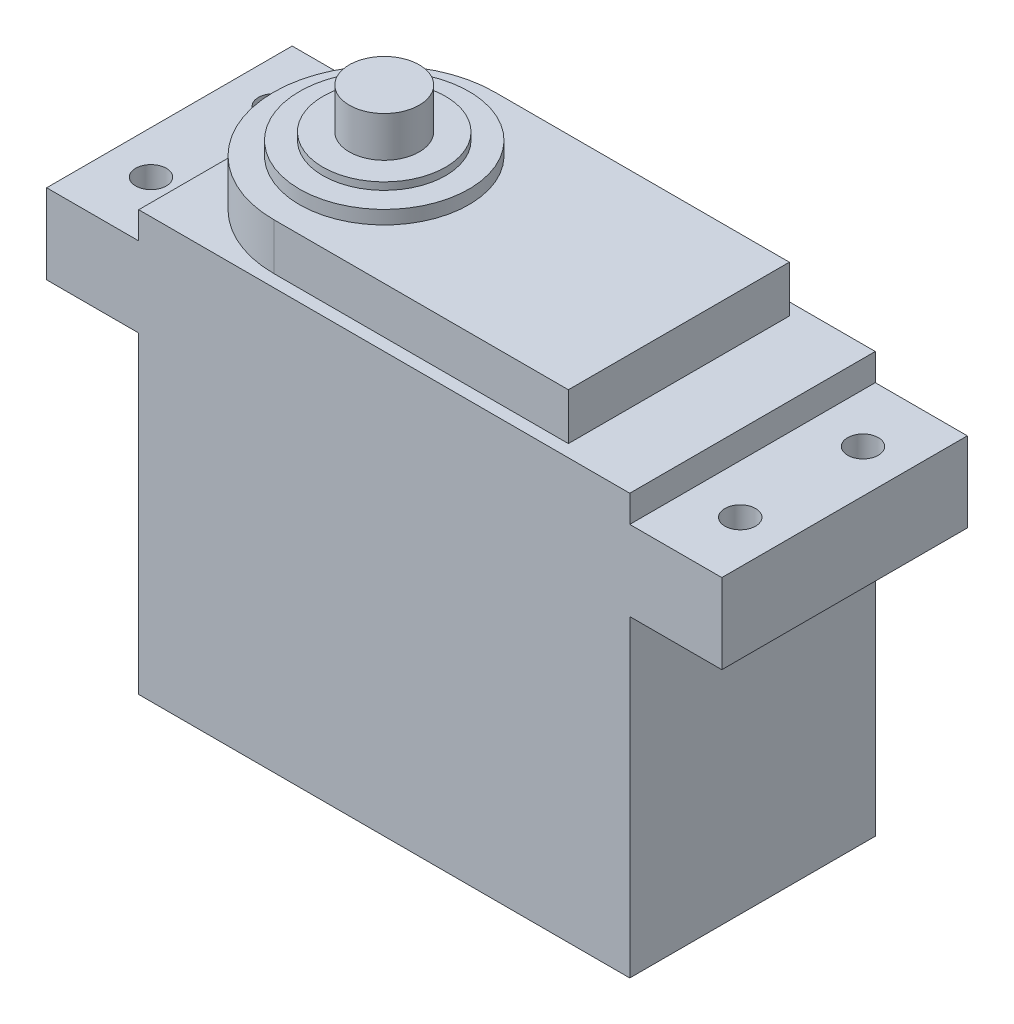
ISO-10303-21;
HEADER;
FILE_DESCRIPTION(('STEP AP214'),'2;1');
FILE_NAME('part.step','',(''),(''),'','','');
FILE_SCHEMA(('AUTOMOTIVE_DESIGN { 1 0 10303 214 1 1 1 1 }'));
ENDSEC;
DATA;
#1=APPLICATION_CONTEXT('core data for automotive mechanical design processes');
#2=APPLICATION_PROTOCOL_DEFINITION('international standard','automotive_design',2000,#1);
#3=PRODUCT_CONTEXT('',#1,'mechanical');
#4=PRODUCT('Part','Part','',(#3));
#5=PRODUCT_RELATED_PRODUCT_CATEGORY('part','',(#4));
#6=PRODUCT_DEFINITION_FORMATION('','',#4);
#7=PRODUCT_DEFINITION_CONTEXT('part definition',#1,'design');
#8=PRODUCT_DEFINITION('design','',#6,#7);
#9=PRODUCT_DEFINITION_SHAPE('','',#8);
#10=(LENGTH_UNIT() NAMED_UNIT(*) SI_UNIT(.MILLI.,.METRE.));
#11=(NAMED_UNIT(*) PLANE_ANGLE_UNIT() SI_UNIT($,.RADIAN.));
#12=(NAMED_UNIT(*) SI_UNIT($,.STERADIAN.) SOLID_ANGLE_UNIT());
#13=UNCERTAINTY_MEASURE_WITH_UNIT(LENGTH_MEASURE(1.E-05),#10,'distance_accuracy_value','');
#14=(GEOMETRIC_REPRESENTATION_CONTEXT(3) GLOBAL_UNCERTAINTY_ASSIGNED_CONTEXT((#13)) GLOBAL_UNIT_ASSIGNED_CONTEXT((#10,
#11,#12)) REPRESENTATION_CONTEXT('',''));
#15=CARTESIAN_POINT('',(0.,0.,0.));
#16=DIRECTION('',(0.,0.,1.));
#17=DIRECTION('',(1.,0.,0.));
#18=AXIS2_PLACEMENT_3D('',#15,#16,#17);
#19=CARTESIAN_POINT('',(0.,0.,10.));
#20=DIRECTION('',(1.,0.,0.));
#21=DIRECTION('',(0.,0.,-1.));
#22=AXIS2_PLACEMENT_3D('',#19,#20,#21);
#23=PLANE('',#22);
#24=DIRECTION('',(0.,-1.,0.));
#25=VECTOR('',#24,1.);
#26=CARTESIAN_POINT('',(0.,0.,-10.));
#27=LINE('',#26,#25);
#28=CARTESIAN_POINT('',(0.,25.5,-10.));
#29=VERTEX_POINT('',#28);
#30=CARTESIAN_POINT('',(0.,0.,-10.));
#31=VERTEX_POINT('',#30);
#32=EDGE_CURVE('E302',#29,#31,#27,.T.);
#33=ORIENTED_EDGE('',*,*,#32,.T.);
#34=DIRECTION('',(0.,0.,-1.));
#35=VECTOR('',#34,1.);
#36=CARTESIAN_POINT('',(0.,0.,10.));
#37=LINE('',#36,#35);
#38=CARTESIAN_POINT('',(0.,0.,10.));
#39=VERTEX_POINT('',#38);
#40=EDGE_CURVE('E12',#39,#31,#37,.T.);
#41=ORIENTED_EDGE('',*,*,#40,.F.);
#42=DIRECTION('',(0.,-1.,0.));
#43=VECTOR('',#42,1.);
#44=CARTESIAN_POINT('',(0.,0.,10.));
#45=LINE('',#44,#43);
#46=CARTESIAN_POINT('',(0.,25.5,10.));
#47=VERTEX_POINT('',#46);
#48=EDGE_CURVE('E275',#47,#39,#45,.T.);
#49=ORIENTED_EDGE('',*,*,#48,.F.);
#50=DIRECTION('',(0.,0.,-1.));
#51=VECTOR('',#50,1.);
#52=CARTESIAN_POINT('',(0.,25.5,10.));
#53=LINE('',#52,#51);
#54=EDGE_CURVE('E301',#47,#29,#53,.T.);
#55=ORIENTED_EDGE('',*,*,#54,.T.);
#56=EDGE_LOOP('',(#33,#41,#49,#55));
#57=FACE_BOUND('',#56,.T.);
#58=DIRECTION('',(0.,-1.,0.));
#59=VECTOR('',#58,1.);
#60=CARTESIAN_POINT('',(0.,3.5,-3.));
#61=LINE('',#60,#59);
#62=CARTESIAN_POINT('',(0.,3.5,-3.));
#63=VERTEX_POINT('',#62);
#64=CARTESIAN_POINT('',(0.,0.5,-3.));
#65=VERTEX_POINT('',#64);
#66=EDGE_CURVE('E196',#63,#65,#61,.T.);
#67=ORIENTED_EDGE('',*,*,#66,.F.);
#68=DIRECTION('',(0.,0.,-1.));
#69=VECTOR('',#68,1.);
#70=CARTESIAN_POINT('',(0.,3.5,-3.));
#71=LINE('',#70,#69);
#72=CARTESIAN_POINT('',(0.,3.5,3.));
#73=VERTEX_POINT('',#72);
#74=EDGE_CURVE('E193',#73,#63,#71,.T.);
#75=ORIENTED_EDGE('',*,*,#74,.F.);
#76=DIRECTION('',(0.,1.,0.));
#77=VECTOR('',#76,1.);
#78=CARTESIAN_POINT('',(0.,3.5,3.));
#79=LINE('',#78,#77);
#80=CARTESIAN_POINT('',(0.,0.5,3.));
#81=VERTEX_POINT('',#80);
#82=EDGE_CURVE('E59',#81,#73,#79,.T.);
#83=ORIENTED_EDGE('',*,*,#82,.F.);
#84=DIRECTION('',(0.,0.,1.));
#85=VECTOR('',#84,1.);
#86=CARTESIAN_POINT('',(0.,0.5,-3.));
#87=LINE('',#86,#85);
#88=EDGE_CURVE('E54',#65,#81,#87,.T.);
#89=ORIENTED_EDGE('',*,*,#88,.F.);
#90=EDGE_LOOP('',(#67,#75,#83,#89));
#91=FACE_BOUND('',#90,.T.);
#92=ADVANCED_FACE('F38',(#57,#91),#23,.F.);
#93=CARTESIAN_POINT('',(0.,39.1,10.));
#94=DIRECTION('',(0.,1.,0.));
#95=DIRECTION('',(0.,0.,1.));
#96=AXIS2_PLACEMENT_3D('',#93,#94,#95);
#97=PLANE('',#96);
#98=CARTESIAN_POINT('',(10.,39.1,0.));
#99=DIRECTION('',(0.,1.,0.));
#100=DIRECTION('',(0.,0.,1.));
#101=AXIS2_PLACEMENT_3D('',#98,#99,#100);
#102=CIRCLE('',#101,6.9);
#103=CARTESIAN_POINT('',(10.,39.1,6.9));
#104=VERTEX_POINT('',#103);
#105=EDGE_CURVE('E217',#104,#104,#102,.T.);
#106=ORIENTED_EDGE('',*,*,#105,.T.);
#107=EDGE_LOOP('',(#106));
#108=FACE_BOUND('',#107,.T.);
#109=CARTESIAN_POINT('',(10.,39.1,0.));
#110=DIRECTION('',(0.,1.,0.));
#111=DIRECTION('',(0.,0.,1.));
#112=AXIS2_PLACEMENT_3D('',#109,#110,#111);
#113=CIRCLE('',#112,5.);
#114=CARTESIAN_POINT('',(10.,39.1,5.));
#115=VERTEX_POINT('',#114);
#116=EDGE_CURVE('E208',#115,#115,#113,.T.);
#117=ORIENTED_EDGE('',*,*,#116,.F.);
#118=EDGE_LOOP('',(#117));
#119=FACE_BOUND('',#118,.T.);
#120=ADVANCED_FACE('F380',(#108,#119),#97,.T.);
#121=CARTESIAN_POINT('',(0.,38.,10.));
#122=DIRECTION('',(0.,1.,0.));
#123=DIRECTION('',(0.,0.,1.));
#124=AXIS2_PLACEMENT_3D('',#121,#122,#123);
#125=PLANE('',#124);
#126=DIRECTION('',(1.,0.,0.));
#127=VECTOR('',#126,1.);
#128=CARTESIAN_POINT('',(34.,38.,9.));
#129=LINE('',#128,#127);
#130=CARTESIAN_POINT('',(10.,38.,9.));
#131=VERTEX_POINT('',#130);
#132=CARTESIAN_POINT('',(34.,38.,9.));
#133=VERTEX_POINT('',#132);
#134=EDGE_CURVE('E224',#131,#133,#129,.T.);
#135=ORIENTED_EDGE('',*,*,#134,.T.);
#136=DIRECTION('',(0.,0.,-1.));
#137=VECTOR('',#136,1.);
#138=CARTESIAN_POINT('',(34.,38.,-9.));
#139=LINE('',#138,#137);
#140=CARTESIAN_POINT('',(34.,38.,-9.));
#141=VERTEX_POINT('',#140);
#142=EDGE_CURVE('E244',#133,#141,#139,.T.);
#143=ORIENTED_EDGE('',*,*,#142,.T.);
#144=DIRECTION('',(-1.,0.,0.));
#145=VECTOR('',#144,1.);
#146=CARTESIAN_POINT('',(10.,38.,-9.));
#147=LINE('',#146,#145);
#148=CARTESIAN_POINT('',(10.,38.,-9.));
#149=VERTEX_POINT('',#148);
#150=EDGE_CURVE('E241',#141,#149,#147,.T.);
#151=ORIENTED_EDGE('',*,*,#150,.T.);
#152=CARTESIAN_POINT('',(10.,38.,0.));
#153=DIRECTION('',(0.,1.,0.));
#154=DIRECTION('',(0.,0.,1.));
#155=AXIS2_PLACEMENT_3D('',#152,#153,#154);
#156=CIRCLE('',#155,9.);
#157=EDGE_CURVE('E237',#149,#131,#156,.T.);
#158=ORIENTED_EDGE('',*,*,#157,.T.);
#159=EDGE_LOOP('',(#135,#143,#151,#158));
#160=FACE_BOUND('',#159,.T.);
#161=CARTESIAN_POINT('',(10.,38.,0.));
#162=DIRECTION('',(0.,1.,0.));
#163=DIRECTION('',(0.,0.,1.));
#164=AXIS2_PLACEMENT_3D('',#161,#162,#163);
#165=CIRCLE('',#164,6.9);
#166=CARTESIAN_POINT('',(10.,38.,6.9));
#167=VERTEX_POINT('',#166);
#168=EDGE_CURVE('E214',#167,#167,#165,.T.);
#169=ORIENTED_EDGE('',*,*,#168,.F.);
#170=EDGE_LOOP('',(#169));
#171=FACE_BOUND('',#170,.T.);
#172=ADVANCED_FACE('F385',(#160,#171),#125,.T.);
#173=CARTESIAN_POINT('',(0.,34.2,10.));
#174=DIRECTION('',(0.,-1.,0.));
#175=DIRECTION('',(0.,0.,-1.));
#176=AXIS2_PLACEMENT_3D('',#173,#174,#175);
#177=PLANE('',#176);
#178=DIRECTION('',(-1.,0.,0.));
#179=VECTOR('',#178,1.);
#180=CARTESIAN_POINT('',(0.,34.2,-10.));
#181=LINE('',#180,#179);
#182=CARTESIAN_POINT('',(40.,34.2,-10.));
#183=VERTEX_POINT('',#182);
#184=CARTESIAN_POINT('',(0.,34.2,-10.));
#185=VERTEX_POINT('',#184);
#186=EDGE_CURVE('E317',#183,#185,#181,.T.);
#187=ORIENTED_EDGE('',*,*,#186,.T.);
#188=DIRECTION('',(0.,0.,-1.));
#189=VECTOR('',#188,1.);
#190=CARTESIAN_POINT('',(0.,34.2,10.));
#191=LINE('',#190,#189);
#192=CARTESIAN_POINT('',(0.,34.2,10.));
#193=VERTEX_POINT('',#192);
#194=EDGE_CURVE('E337',#193,#185,#191,.T.);
#195=ORIENTED_EDGE('',*,*,#194,.F.);
#196=DIRECTION('',(-1.,0.,0.));
#197=VECTOR('',#196,1.);
#198=CARTESIAN_POINT('',(0.,34.2,10.));
#199=LINE('',#198,#197);
#200=CARTESIAN_POINT('',(40.,34.2,10.));
#201=VERTEX_POINT('',#200);
#202=EDGE_CURVE('E291',#201,#193,#199,.T.);
#203=ORIENTED_EDGE('',*,*,#202,.F.);
#204=DIRECTION('',(0.,0.,-1.));
#205=VECTOR('',#204,1.);
#206=CARTESIAN_POINT('',(40.,34.2,10.));
#207=LINE('',#206,#205);
#208=EDGE_CURVE('E340',#201,#183,#207,.T.);
#209=ORIENTED_EDGE('',*,*,#208,.T.);
#210=EDGE_LOOP('',(#187,#195,#203,#209));
#211=FACE_BOUND('',#210,.T.);
#212=DIRECTION('',(0.,0.,-1.));
#213=VECTOR('',#212,1.);
#214=CARTESIAN_POINT('',(34.,34.2,-9.));
#215=LINE('',#214,#213);
#216=CARTESIAN_POINT('',(34.,34.2,9.));
#217=VERTEX_POINT('',#216);
#218=CARTESIAN_POINT('',(34.,34.2,-9.));
#219=VERTEX_POINT('',#218);
#220=EDGE_CURVE('E234',#217,#219,#215,.T.);
#221=ORIENTED_EDGE('',*,*,#220,.F.);
#222=DIRECTION('',(1.,0.,0.));
#223=VECTOR('',#222,1.);
#224=CARTESIAN_POINT('',(34.,34.2,9.));
#225=LINE('',#224,#223);
#226=CARTESIAN_POINT('',(10.,34.2,9.));
#227=VERTEX_POINT('',#226);
#228=EDGE_CURVE('E221',#227,#217,#225,.T.);
#229=ORIENTED_EDGE('',*,*,#228,.F.);
#230=CARTESIAN_POINT('',(10.,34.2,0.));
#231=DIRECTION('',(0.,1.,0.));
#232=DIRECTION('',(0.,0.,1.));
#233=AXIS2_PLACEMENT_3D('',#230,#231,#232);
#234=CIRCLE('',#233,9.);
#235=CARTESIAN_POINT('',(10.,34.2,-9.));
#236=VERTEX_POINT('',#235);
#237=EDGE_CURVE('E226',#236,#227,#234,.T.);
#238=ORIENTED_EDGE('',*,*,#237,.F.);
#239=DIRECTION('',(-1.,0.,0.));
#240=VECTOR('',#239,1.);
#241=CARTESIAN_POINT('',(10.,34.2,-9.));
#242=LINE('',#241,#240);
#243=EDGE_CURVE('E230',#219,#236,#242,.T.);
#244=ORIENTED_EDGE('',*,*,#243,.F.);
#245=EDGE_LOOP('',(#221,#229,#238,#244));
#246=FACE_BOUND('',#245,.T.);
#247=ADVANCED_FACE('F502',(#211,#246),#177,.F.);
#248=CARTESIAN_POINT('',(0.,0.,10.));
#249=DIRECTION('',(0.,1.,0.));
#250=DIRECTION('',(0.,0.,1.));
#251=AXIS2_PLACEMENT_3D('',#248,#249,#250);
#252=PLANE('',#251);
#253=DIRECTION('',(1.,0.,0.));
#254=VECTOR('',#253,1.);
#255=CARTESIAN_POINT('',(0.,0.,-10.));
#256=LINE('',#255,#254);
#257=CARTESIAN_POINT('',(40.,0.,-10.));
#258=VERTEX_POINT('',#257);
#259=EDGE_CURVE('E305',#31,#258,#256,.T.);
#260=ORIENTED_EDGE('',*,*,#259,.T.);
#261=DIRECTION('',(0.,0.,-1.));
#262=VECTOR('',#261,1.);
#263=CARTESIAN_POINT('',(40.,0.,10.));
#264=LINE('',#263,#262);
#265=CARTESIAN_POINT('',(40.,0.,10.));
#266=VERTEX_POINT('',#265);
#267=EDGE_CURVE('E46',#266,#258,#264,.T.);
#268=ORIENTED_EDGE('',*,*,#267,.F.);
#269=DIRECTION('',(1.,0.,0.));
#270=VECTOR('',#269,1.);
#271=CARTESIAN_POINT('',(0.,0.,10.));
#272=LINE('',#271,#270);
#273=EDGE_CURVE('E278',#39,#266,#272,.T.);
#274=ORIENTED_EDGE('',*,*,#273,.F.);
#275=ORIENTED_EDGE('',*,*,#40,.T.);
#276=EDGE_LOOP('',(#260,#268,#274,#275));
#277=FACE_BOUND('',#276,.T.);
#278=ADVANCED_FACE('F550',(#277),#252,.F.);
#279=CARTESIAN_POINT('',(40.,0.,10.));
#280=DIRECTION('',(-1.,0.,0.));
#281=DIRECTION('',(0.,0.,1.));
#282=AXIS2_PLACEMENT_3D('',#279,#280,#281);
#283=PLANE('',#282);
#284=DIRECTION('',(0.,1.,0.));
#285=VECTOR('',#284,1.);
#286=CARTESIAN_POINT('',(40.,0.,-10.));
#287=LINE('',#286,#285);
#288=CARTESIAN_POINT('',(40.,25.5,-10.));
#289=VERTEX_POINT('',#288);
#290=EDGE_CURVE('E307',#258,#289,#287,.T.);
#291=ORIENTED_EDGE('',*,*,#290,.T.);
#292=DIRECTION('',(0.,0.,-1.));
#293=VECTOR('',#292,1.);
#294=CARTESIAN_POINT('',(40.,25.5,10.));
#295=LINE('',#294,#293);
#296=CARTESIAN_POINT('',(40.,25.5,10.));
#297=VERTEX_POINT('',#296);
#298=EDGE_CURVE('E352',#297,#289,#295,.T.);
#299=ORIENTED_EDGE('',*,*,#298,.F.);
#300=DIRECTION('',(0.,1.,0.));
#301=VECTOR('',#300,1.);
#302=CARTESIAN_POINT('',(40.,0.,10.));
#303=LINE('',#302,#301);
#304=EDGE_CURVE('E281',#266,#297,#303,.T.);
#305=ORIENTED_EDGE('',*,*,#304,.F.);
#306=ORIENTED_EDGE('',*,*,#267,.T.);
#307=EDGE_LOOP('',(#291,#299,#305,#306));
#308=FACE_BOUND('',#307,.T.);
#309=ADVANCED_FACE('F519',(#308),#283,.F.);
#310=CARTESIAN_POINT('',(40.,25.5,10.));
#311=DIRECTION('',(0.,1.,0.));
#312=DIRECTION('',(0.,0.,1.));
#313=AXIS2_PLACEMENT_3D('',#310,#311,#312);
#314=PLANE('',#313);
#315=CARTESIAN_POINT('',(44.,25.5,-4.99999999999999));
#316=DIRECTION('',(0.,1.,0.));
#317=DIRECTION('',(0.,0.,1.));
#318=AXIS2_PLACEMENT_3D('',#315,#316,#317);
#319=CIRCLE('',#318,1.25);
#320=CARTESIAN_POINT('',(44.,25.5,-3.75));
#321=VERTEX_POINT('',#320);
#322=EDGE_CURVE('E259',#321,#321,#319,.T.);
#323=ORIENTED_EDGE('',*,*,#322,.T.);
#324=EDGE_LOOP('',(#323));
#325=FACE_BOUND('',#324,.T.);
#326=CARTESIAN_POINT('',(44.,25.5,5.00000000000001));
#327=DIRECTION('',(0.,1.,0.));
#328=DIRECTION('',(0.,0.,1.));
#329=AXIS2_PLACEMENT_3D('',#326,#327,#328);
#330=CIRCLE('',#329,1.25);
#331=CARTESIAN_POINT('',(44.,25.5,6.25));
#332=VERTEX_POINT('',#331);
#333=EDGE_CURVE('E265',#332,#332,#330,.T.);
#334=ORIENTED_EDGE('',*,*,#333,.T.);
#335=EDGE_LOOP('',(#334));
#336=FACE_BOUND('',#335,.T.);
#337=DIRECTION('',(1.,0.,0.));
#338=VECTOR('',#337,1.);
#339=CARTESIAN_POINT('',(40.,25.5,-10.));
#340=LINE('',#339,#338);
#341=CARTESIAN_POINT('',(47.5,25.5,-10.));
#342=VERTEX_POINT('',#341);
#343=EDGE_CURVE('E309',#289,#342,#340,.T.);
#344=ORIENTED_EDGE('',*,*,#343,.T.);
#345=DIRECTION('',(0.,0.,-1.));
#346=VECTOR('',#345,1.);
#347=CARTESIAN_POINT('',(47.5,25.5,10.));
#348=LINE('',#347,#346);
#349=CARTESIAN_POINT('',(47.5,25.5,10.));
#350=VERTEX_POINT('',#349);
#351=EDGE_CURVE('E349',#350,#342,#348,.T.);
#352=ORIENTED_EDGE('',*,*,#351,.F.);
#353=DIRECTION('',(1.,0.,0.));
#354=VECTOR('',#353,1.);
#355=CARTESIAN_POINT('',(40.,25.5,10.));
#356=LINE('',#355,#354);
#357=EDGE_CURVE('E283',#297,#350,#356,.T.);
#358=ORIENTED_EDGE('',*,*,#357,.F.);
#359=ORIENTED_EDGE('',*,*,#298,.T.);
#360=EDGE_LOOP('',(#344,#352,#358,#359));
#361=FACE_BOUND('',#360,.T.);
#362=ADVANCED_FACE('F515',(#325,#336,#361),#314,.F.);
#363=CARTESIAN_POINT('',(47.5,25.5,10.));
#364=DIRECTION('',(-1.,0.,0.));
#365=DIRECTION('',(0.,0.,1.));
#366=AXIS2_PLACEMENT_3D('',#363,#364,#365);
#367=PLANE('',#366);
#368=DIRECTION('',(0.,1.,0.));
#369=VECTOR('',#368,1.);
#370=CARTESIAN_POINT('',(47.5,25.5,-10.));
#371=LINE('',#370,#369);
#372=CARTESIAN_POINT('',(47.5,32.,-10.));
#373=VERTEX_POINT('',#372);
#374=EDGE_CURVE('E311',#342,#373,#371,.T.);
#375=ORIENTED_EDGE('',*,*,#374,.T.);
#376=DIRECTION('',(0.,0.,-1.));
#377=VECTOR('',#376,1.);
#378=CARTESIAN_POINT('',(47.5,32.,10.));
#379=LINE('',#378,#377);
#380=CARTESIAN_POINT('',(47.5,32.,10.));
#381=VERTEX_POINT('',#380);
#382=EDGE_CURVE('E346',#381,#373,#379,.T.);
#383=ORIENTED_EDGE('',*,*,#382,.F.);
#384=DIRECTION('',(0.,1.,0.));
#385=VECTOR('',#384,1.);
#386=CARTESIAN_POINT('',(47.5,25.5,10.));
#387=LINE('',#386,#385);
#388=EDGE_CURVE('E285',#350,#381,#387,.T.);
#389=ORIENTED_EDGE('',*,*,#388,.F.);
#390=ORIENTED_EDGE('',*,*,#351,.T.);
#391=EDGE_LOOP('',(#375,#383,#389,#390));
#392=FACE_BOUND('',#391,.T.);
#393=ADVANCED_FACE('F518',(#392),#367,.F.);
#394=CARTESIAN_POINT('',(47.5,32.,10.));
#395=DIRECTION('',(0.,-1.,0.));
#396=DIRECTION('',(0.,0.,-1.));
#397=AXIS2_PLACEMENT_3D('',#394,#395,#396);
#398=PLANE('',#397);
#399=CARTESIAN_POINT('',(44.,32.,-4.99999999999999));
#400=DIRECTION('',(0.,1.,0.));
#401=DIRECTION('',(0.,0.,1.));
#402=AXIS2_PLACEMENT_3D('',#399,#400,#401);
#403=CIRCLE('',#402,1.25);
#404=CARTESIAN_POINT('',(44.,32.,-3.75));
#405=VERTEX_POINT('',#404);
#406=EDGE_CURVE('E240',#405,#405,#403,.T.);
#407=ORIENTED_EDGE('',*,*,#406,.F.);
#408=EDGE_LOOP('',(#407));
#409=FACE_BOUND('',#408,.T.);
#410=CARTESIAN_POINT('',(44.,32.,5.00000000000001));
#411=DIRECTION('',(0.,1.,0.));
#412=DIRECTION('',(0.,0.,1.));
#413=AXIS2_PLACEMENT_3D('',#410,#411,#412);
#414=CIRCLE('',#413,1.25);
#415=CARTESIAN_POINT('',(44.,32.,6.25));
#416=VERTEX_POINT('',#415);
#417=EDGE_CURVE('E262',#416,#416,#414,.T.);
#418=ORIENTED_EDGE('',*,*,#417,.F.);
#419=EDGE_LOOP('',(#418));
#420=FACE_BOUND('',#419,.T.);
#421=DIRECTION('',(-1.,0.,0.));
#422=VECTOR('',#421,1.);
#423=CARTESIAN_POINT('',(47.5,32.,-10.));
#424=LINE('',#423,#422);
#425=CARTESIAN_POINT('',(40.,32.,-10.));
#426=VERTEX_POINT('',#425);
#427=EDGE_CURVE('E313',#373,#426,#424,.T.);
#428=ORIENTED_EDGE('',*,*,#427,.T.);
#429=DIRECTION('',(0.,0.,-1.));
#430=VECTOR('',#429,1.);
#431=CARTESIAN_POINT('',(40.,32.,10.));
#432=LINE('',#431,#430);
#433=CARTESIAN_POINT('',(40.,32.,10.));
#434=VERTEX_POINT('',#433);
#435=EDGE_CURVE('E343',#434,#426,#432,.T.);
#436=ORIENTED_EDGE('',*,*,#435,.F.);
#437=DIRECTION('',(-1.,0.,0.));
#438=VECTOR('',#437,1.);
#439=CARTESIAN_POINT('',(47.5,32.,10.));
#440=LINE('',#439,#438);
#441=EDGE_CURVE('E287',#381,#434,#440,.T.);
#442=ORIENTED_EDGE('',*,*,#441,.F.);
#443=ORIENTED_EDGE('',*,*,#382,.T.);
#444=EDGE_LOOP('',(#428,#436,#442,#443));
#445=FACE_BOUND('',#444,.T.);
#446=ADVANCED_FACE('F536',(#409,#420,#445),#398,.F.);
#447=CARTESIAN_POINT('',(40.,32.,10.));
#448=DIRECTION('',(-1.,0.,0.));
#449=DIRECTION('',(0.,0.,1.));
#450=AXIS2_PLACEMENT_3D('',#447,#448,#449);
#451=PLANE('',#450);
#452=DIRECTION('',(0.,1.,0.));
#453=VECTOR('',#452,1.);
#454=CARTESIAN_POINT('',(40.,32.,-10.));
#455=LINE('',#454,#453);
#456=EDGE_CURVE('E315',#426,#183,#455,.T.);
#457=ORIENTED_EDGE('',*,*,#456,.T.);
#458=ORIENTED_EDGE('',*,*,#208,.F.);
#459=DIRECTION('',(0.,1.,0.));
#460=VECTOR('',#459,1.);
#461=CARTESIAN_POINT('',(40.,32.,10.));
#462=LINE('',#461,#460);
#463=EDGE_CURVE('E289',#434,#201,#462,.T.);
#464=ORIENTED_EDGE('',*,*,#463,.F.);
#465=ORIENTED_EDGE('',*,*,#435,.T.);
#466=EDGE_LOOP('',(#457,#458,#464,#465));
#467=FACE_BOUND('',#466,.T.);
#468=ADVANCED_FACE('F540',(#467),#451,.F.);
#469=CARTESIAN_POINT('',(0.,32.,10.));
#470=DIRECTION('',(1.,0.,0.));
#471=DIRECTION('',(0.,0.,-1.));
#472=AXIS2_PLACEMENT_3D('',#469,#470,#471);
#473=PLANE('',#472);
#474=DIRECTION('',(0.,-1.,0.));
#475=VECTOR('',#474,1.);
#476=CARTESIAN_POINT('',(0.,32.,-10.));
#477=LINE('',#476,#475);
#478=CARTESIAN_POINT('',(0.,32.,-10.));
#479=VERTEX_POINT('',#478);
#480=EDGE_CURVE('E319',#185,#479,#477,.T.);
#481=ORIENTED_EDGE('',*,*,#480,.T.);
#482=DIRECTION('',(0.,0.,-1.));
#483=VECTOR('',#482,1.);
#484=CARTESIAN_POINT('',(0.,32.,10.));
#485=LINE('',#484,#483);
#486=CARTESIAN_POINT('',(0.,32.,10.));
#487=VERTEX_POINT('',#486);
#488=EDGE_CURVE('E334',#487,#479,#485,.T.);
#489=ORIENTED_EDGE('',*,*,#488,.F.);
#490=DIRECTION('',(0.,-1.,0.));
#491=VECTOR('',#490,1.);
#492=CARTESIAN_POINT('',(0.,32.,10.));
#493=LINE('',#492,#491);
#494=EDGE_CURVE('E293',#193,#487,#493,.T.);
#495=ORIENTED_EDGE('',*,*,#494,.F.);
#496=ORIENTED_EDGE('',*,*,#194,.T.);
#497=EDGE_LOOP('',(#481,#489,#495,#496));
#498=FACE_BOUND('',#497,.T.);
#499=ADVANCED_FACE('F568',(#498),#473,.F.);
#500=CARTESIAN_POINT('',(0.,32.,10.));
#501=DIRECTION('',(0.,-1.,0.));
#502=DIRECTION('',(0.,0.,-1.));
#503=AXIS2_PLACEMENT_3D('',#500,#501,#502);
#504=PLANE('',#503);
#505=CARTESIAN_POINT('',(-4.,32.,5.00000000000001));
#506=DIRECTION('',(0.,1.,0.));
#507=DIRECTION('',(0.,0.,1.));
#508=AXIS2_PLACEMENT_3D('',#505,#506,#507);
#509=CIRCLE('',#508,1.25);
#510=CARTESIAN_POINT('',(-4.,32.,6.25000000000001));
#511=VERTEX_POINT('',#510);
#512=EDGE_CURVE('E268',#511,#511,#509,.T.);
#513=ORIENTED_EDGE('',*,*,#512,.F.);
#514=EDGE_LOOP('',(#513));
#515=FACE_BOUND('',#514,.T.);
#516=CARTESIAN_POINT('',(-4.,32.,-5.00000000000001));
#517=DIRECTION('',(0.,1.,0.));
#518=DIRECTION('',(0.,0.,1.));
#519=AXIS2_PLACEMENT_3D('',#516,#517,#518);
#520=CIRCLE('',#519,1.25);
#521=CARTESIAN_POINT('',(-4.,32.,-3.75));
#522=VERTEX_POINT('',#521);
#523=EDGE_CURVE('E271',#522,#522,#520,.T.);
#524=ORIENTED_EDGE('',*,*,#523,.F.);
#525=EDGE_LOOP('',(#524));
#526=FACE_BOUND('',#525,.T.);
#527=DIRECTION('',(-1.,0.,0.));
#528=VECTOR('',#527,1.);
#529=CARTESIAN_POINT('',(0.,32.,-10.));
#530=LINE('',#529,#528);
#531=CARTESIAN_POINT('',(-7.5,32.,-10.));
#532=VERTEX_POINT('',#531);
#533=EDGE_CURVE('E321',#479,#532,#530,.T.);
#534=ORIENTED_EDGE('',*,*,#533,.T.);
#535=DIRECTION('',(0.,0.,-1.));
#536=VECTOR('',#535,1.);
#537=CARTESIAN_POINT('',(-7.5,32.,10.));
#538=LINE('',#537,#536);
#539=CARTESIAN_POINT('',(-7.5,32.,10.));
#540=VERTEX_POINT('',#539);
#541=EDGE_CURVE('E331',#540,#532,#538,.T.);
#542=ORIENTED_EDGE('',*,*,#541,.F.);
#543=DIRECTION('',(-1.,0.,0.));
#544=VECTOR('',#543,1.);
#545=CARTESIAN_POINT('',(0.,32.,10.));
#546=LINE('',#545,#544);
#547=EDGE_CURVE('E295',#487,#540,#546,.T.);
#548=ORIENTED_EDGE('',*,*,#547,.F.);
#549=ORIENTED_EDGE('',*,*,#488,.T.);
#550=EDGE_LOOP('',(#534,#542,#548,#549));
#551=FACE_BOUND('',#550,.T.);
#552=ADVANCED_FACE('F564',(#515,#526,#551),#504,.F.);
#553=CARTESIAN_POINT('',(-7.5,25.5,10.));
#554=DIRECTION('',(1.,0.,0.));
#555=DIRECTION('',(0.,0.,-1.));
#556=AXIS2_PLACEMENT_3D('',#553,#554,#555);
#557=PLANE('',#556);
#558=DIRECTION('',(0.,-1.,0.));
#559=VECTOR('',#558,1.);
#560=CARTESIAN_POINT('',(-7.5,25.5,-10.));
#561=LINE('',#560,#559);
#562=CARTESIAN_POINT('',(-7.5,25.5,-10.));
#563=VERTEX_POINT('',#562);
#564=EDGE_CURVE('E323',#532,#563,#561,.T.);
#565=ORIENTED_EDGE('',*,*,#564,.T.);
#566=DIRECTION('',(0.,0.,-1.));
#567=VECTOR('',#566,1.);
#568=CARTESIAN_POINT('',(-7.5,25.5,10.));
#569=LINE('',#568,#567);
#570=CARTESIAN_POINT('',(-7.5,25.5,10.));
#571=VERTEX_POINT('',#570);
#572=EDGE_CURVE('E328',#571,#563,#569,.T.);
#573=ORIENTED_EDGE('',*,*,#572,.F.);
#574=DIRECTION('',(0.,-1.,0.));
#575=VECTOR('',#574,1.);
#576=CARTESIAN_POINT('',(-7.5,25.5,10.));
#577=LINE('',#576,#575);
#578=EDGE_CURVE('E297',#540,#571,#577,.T.);
#579=ORIENTED_EDGE('',*,*,#578,.F.);
#580=ORIENTED_EDGE('',*,*,#541,.T.);
#581=EDGE_LOOP('',(#565,#573,#579,#580));
#582=FACE_BOUND('',#581,.T.);
#583=ADVANCED_FACE('F560',(#582),#557,.F.);
#584=CARTESIAN_POINT('',(-7.5,25.5,10.));
#585=DIRECTION('',(0.,1.,0.));
#586=DIRECTION('',(0.,0.,1.));
#587=AXIS2_PLACEMENT_3D('',#584,#585,#586);
#588=PLANE('',#587);
#589=CARTESIAN_POINT('',(-4.,25.5,5.00000000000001));
#590=DIRECTION('',(0.,1.,0.));
#591=DIRECTION('',(0.,0.,1.));
#592=AXIS2_PLACEMENT_3D('',#589,#590,#591);
#593=CIRCLE('',#592,1.25);
#594=CARTESIAN_POINT('',(-4.,25.5,6.25000000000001));
#595=VERTEX_POINT('',#594);
#596=EDGE_CURVE('E41',#595,#595,#593,.T.);
#597=ORIENTED_EDGE('',*,*,#596,.T.);
#598=EDGE_LOOP('',(#597));
#599=FACE_BOUND('',#598,.T.);
#600=CARTESIAN_POINT('',(-4.,25.5,-5.00000000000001));
#601=DIRECTION('',(0.,1.,0.));
#602=DIRECTION('',(0.,0.,1.));
#603=AXIS2_PLACEMENT_3D('',#600,#601,#602);
#604=CIRCLE('',#603,1.25);
#605=CARTESIAN_POINT('',(-4.,25.5,-3.75));
#606=VERTEX_POINT('',#605);
#607=EDGE_CURVE('E274',#606,#606,#604,.T.);
#608=ORIENTED_EDGE('',*,*,#607,.T.);
#609=EDGE_LOOP('',(#608));
#610=FACE_BOUND('',#609,.T.);
#611=DIRECTION('',(1.,0.,0.));
#612=VECTOR('',#611,1.);
#613=CARTESIAN_POINT('',(-7.5,25.5,-10.));
#614=LINE('',#613,#612);
#615=EDGE_CURVE('E279',#563,#29,#614,.T.);
#616=ORIENTED_EDGE('',*,*,#615,.T.);
#617=ORIENTED_EDGE('',*,*,#54,.F.);
#618=DIRECTION('',(1.,0.,0.));
#619=VECTOR('',#618,1.);
#620=CARTESIAN_POINT('',(-7.5,25.5,10.));
#621=LINE('',#620,#619);
#622=EDGE_CURVE('E299',#571,#47,#621,.T.);
#623=ORIENTED_EDGE('',*,*,#622,.F.);
#624=ORIENTED_EDGE('',*,*,#572,.T.);
#625=EDGE_LOOP('',(#616,#617,#623,#624));
#626=FACE_BOUND('',#625,.T.);
#627=ADVANCED_FACE('F359',(#599,#610,#626),#588,.F.);
#628=CARTESIAN_POINT('',(0.,25.5,10.));
#629=DIRECTION('',(0.,0.,-1.));
#630=DIRECTION('',(-1.,0.,0.));
#631=AXIS2_PLACEMENT_3D('',#628,#629,#630);
#632=PLANE('',#631);
#633=ORIENTED_EDGE('',*,*,#48,.T.);
#634=ORIENTED_EDGE('',*,*,#273,.T.);
#635=ORIENTED_EDGE('',*,*,#304,.T.);
#636=ORIENTED_EDGE('',*,*,#357,.T.);
#637=ORIENTED_EDGE('',*,*,#388,.T.);
#638=ORIENTED_EDGE('',*,*,#441,.T.);
#639=ORIENTED_EDGE('',*,*,#463,.T.);
#640=ORIENTED_EDGE('',*,*,#202,.T.);
#641=ORIENTED_EDGE('',*,*,#494,.T.);
#642=ORIENTED_EDGE('',*,*,#547,.T.);
#643=ORIENTED_EDGE('',*,*,#578,.T.);
#644=ORIENTED_EDGE('',*,*,#622,.T.);
#645=EDGE_LOOP('',(#633,#634,#635,#636,#637,#638,#639,#640,#641,#642,#643,#644));
#646=FACE_BOUND('',#645,.T.);
#647=ADVANCED_FACE('F375',(#646),#632,.F.);
#648=CARTESIAN_POINT('',(0.,25.5,-10.));
#649=DIRECTION('',(0.,0.,-1.));
#650=DIRECTION('',(-1.,0.,0.));
#651=AXIS2_PLACEMENT_3D('',#648,#649,#650);
#652=PLANE('',#651);
#653=ORIENTED_EDGE('',*,*,#32,.F.);
#654=ORIENTED_EDGE('',*,*,#615,.F.);
#655=ORIENTED_EDGE('',*,*,#564,.F.);
#656=ORIENTED_EDGE('',*,*,#533,.F.);
#657=ORIENTED_EDGE('',*,*,#480,.F.);
#658=ORIENTED_EDGE('',*,*,#186,.F.);
#659=ORIENTED_EDGE('',*,*,#456,.F.);
#660=ORIENTED_EDGE('',*,*,#427,.F.);
#661=ORIENTED_EDGE('',*,*,#374,.F.);
#662=ORIENTED_EDGE('',*,*,#343,.F.);
#663=ORIENTED_EDGE('',*,*,#290,.F.);
#664=ORIENTED_EDGE('',*,*,#259,.F.);
#665=EDGE_LOOP('',(#653,#654,#655,#656,#657,#658,#659,#660,#661,#662,#663,#664));
#666=FACE_BOUND('',#665,.T.);
#667=ADVANCED_FACE('F365',(#666),#652,.T.);
#668=CARTESIAN_POINT('',(-4.,0.,-5.00000000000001));
#669=DIRECTION('',(0.,1.,0.));
#670=DIRECTION('',(0.,0.,1.));
#671=AXIS2_PLACEMENT_3D('',#668,#669,#670);
#672=CYLINDRICAL_SURFACE('',#671,1.25);
#673=ORIENTED_EDGE('',*,*,#523,.T.);
#674=EDGE_LOOP('',(#673));
#675=FACE_BOUND('',#674,.T.);
#676=ORIENTED_EDGE('',*,*,#607,.F.);
#677=EDGE_LOOP('',(#676));
#678=FACE_BOUND('',#677,.T.);
#679=ADVANCED_FACE('F362',(#675,#678),#672,.F.);
#680=CARTESIAN_POINT('',(-4.,0.,5.00000000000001));
#681=DIRECTION('',(0.,1.,0.));
#682=DIRECTION('',(0.,0.,1.));
#683=AXIS2_PLACEMENT_3D('',#680,#681,#682);
#684=CYLINDRICAL_SURFACE('',#683,1.25);
#685=ORIENTED_EDGE('',*,*,#512,.T.);
#686=EDGE_LOOP('',(#685));
#687=FACE_BOUND('',#686,.T.);
#688=ORIENTED_EDGE('',*,*,#596,.F.);
#689=EDGE_LOOP('',(#688));
#690=FACE_BOUND('',#689,.T.);
#691=ADVANCED_FACE('F364',(#687,#690),#684,.F.);
#692=CARTESIAN_POINT('',(44.,0.,5.00000000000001));
#693=DIRECTION('',(0.,1.,0.));
#694=DIRECTION('',(0.,0.,1.));
#695=AXIS2_PLACEMENT_3D('',#692,#693,#694);
#696=CYLINDRICAL_SURFACE('',#695,1.25);
#697=ORIENTED_EDGE('',*,*,#417,.T.);
#698=EDGE_LOOP('',(#697));
#699=FACE_BOUND('',#698,.T.);
#700=ORIENTED_EDGE('',*,*,#333,.F.);
#701=EDGE_LOOP('',(#700));
#702=FACE_BOUND('',#701,.T.);
#703=ADVANCED_FACE('F372',(#699,#702),#696,.F.);
#704=CARTESIAN_POINT('',(44.,0.,-4.99999999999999));
#705=DIRECTION('',(0.,1.,0.));
#706=DIRECTION('',(0.,0.,1.));
#707=AXIS2_PLACEMENT_3D('',#704,#705,#706);
#708=CYLINDRICAL_SURFACE('',#707,1.25);
#709=ORIENTED_EDGE('',*,*,#406,.T.);
#710=EDGE_LOOP('',(#709));
#711=FACE_BOUND('',#710,.T.);
#712=ORIENTED_EDGE('',*,*,#322,.F.);
#713=EDGE_LOOP('',(#712));
#714=FACE_BOUND('',#713,.T.);
#715=ADVANCED_FACE('F498',(#711,#714),#708,.F.);
#716=CARTESIAN_POINT('',(34.,113.589892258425,-9.));
#717=DIRECTION('',(-1.,0.,0.));
#718=DIRECTION('',(0.,0.,1.));
#719=AXIS2_PLACEMENT_3D('',#716,#717,#718);
#720=PLANE('',#719);
#721=ORIENTED_EDGE('',*,*,#142,.F.);
#722=DIRECTION('',(0.,-1.,0.));
#723=VECTOR('',#722,1.);
#724=CARTESIAN_POINT('',(34.,113.589892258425,9.));
#725=LINE('',#724,#723);
#726=EDGE_CURVE('E220',#133,#217,#725,.T.);
#727=ORIENTED_EDGE('',*,*,#726,.T.);
#728=ORIENTED_EDGE('',*,*,#220,.T.);
#729=DIRECTION('',(0.,-1.,0.));
#730=VECTOR('',#729,1.);
#731=CARTESIAN_POINT('',(34.,113.589892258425,-9.));
#732=LINE('',#731,#730);
#733=EDGE_CURVE('E233',#141,#219,#732,.T.);
#734=ORIENTED_EDGE('',*,*,#733,.F.);
#735=EDGE_LOOP('',(#721,#727,#728,#734));
#736=FACE_BOUND('',#735,.T.);
#737=ADVANCED_FACE('F494',(#736),#720,.F.);
#738=CARTESIAN_POINT('',(10.,113.589892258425,-9.));
#739=DIRECTION('',(0.,0.,1.));
#740=DIRECTION('',(1.,0.,0.));
#741=AXIS2_PLACEMENT_3D('',#738,#739,#740);
#742=PLANE('',#741);
#743=ORIENTED_EDGE('',*,*,#150,.F.);
#744=ORIENTED_EDGE('',*,*,#733,.T.);
#745=ORIENTED_EDGE('',*,*,#243,.T.);
#746=DIRECTION('',(0.,-1.,0.));
#747=VECTOR('',#746,1.);
#748=CARTESIAN_POINT('',(10.,113.589892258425,-9.));
#749=LINE('',#748,#747);
#750=EDGE_CURVE('E229',#149,#236,#749,.T.);
#751=ORIENTED_EDGE('',*,*,#750,.F.);
#752=EDGE_LOOP('',(#743,#744,#745,#751));
#753=FACE_BOUND('',#752,.T.);
#754=ADVANCED_FACE('F490',(#753),#742,.F.);
#755=CARTESIAN_POINT('',(10.,113.589892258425,0.));
#756=DIRECTION('',(0.,-1.,0.));
#757=DIRECTION('',(0.,0.,-1.));
#758=AXIS2_PLACEMENT_3D('',#755,#756,#757);
#759=CYLINDRICAL_SURFACE('',#758,9.);
#760=ORIENTED_EDGE('',*,*,#157,.F.);
#761=ORIENTED_EDGE('',*,*,#750,.T.);
#762=ORIENTED_EDGE('',*,*,#237,.T.);
#763=DIRECTION('',(0.,-1.,0.));
#764=VECTOR('',#763,1.);
#765=CARTESIAN_POINT('',(10.,113.589892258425,9.));
#766=LINE('',#765,#764);
#767=EDGE_CURVE('E225',#131,#227,#766,.T.);
#768=ORIENTED_EDGE('',*,*,#767,.F.);
#769=EDGE_LOOP('',(#760,#761,#762,#768));
#770=FACE_BOUND('',#769,.T.);
#771=ADVANCED_FACE('F486',(#770),#759,.T.);
#772=CARTESIAN_POINT('',(34.,113.589892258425,9.));
#773=DIRECTION('',(0.,0.,-1.));
#774=DIRECTION('',(-1.,0.,0.));
#775=AXIS2_PLACEMENT_3D('',#772,#773,#774);
#776=PLANE('',#775);
#777=ORIENTED_EDGE('',*,*,#134,.F.);
#778=ORIENTED_EDGE('',*,*,#767,.T.);
#779=ORIENTED_EDGE('',*,*,#228,.T.);
#780=ORIENTED_EDGE('',*,*,#726,.F.);
#781=EDGE_LOOP('',(#777,#778,#779,#780));
#782=FACE_BOUND('',#781,.T.);
#783=ADVANCED_FACE('F481',(#782),#776,.F.);
#784=CARTESIAN_POINT('',(10.,97.7161471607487,0.));
#785=DIRECTION('',(0.,-1.,0.));
#786=DIRECTION('',(0.,0.,-1.));
#787=AXIS2_PLACEMENT_3D('',#784,#785,#786);
#788=CYLINDRICAL_SURFACE('',#787,6.9);
#789=ORIENTED_EDGE('',*,*,#168,.T.);
#790=EDGE_LOOP('',(#789));
#791=FACE_BOUND('',#790,.T.);
#792=ORIENTED_EDGE('',*,*,#105,.F.);
#793=EDGE_LOOP('',(#792));
#794=FACE_BOUND('',#793,.T.);
#795=ADVANCED_FACE('F475',(#791,#794),#788,.T.);
#796=CARTESIAN_POINT('',(10.,93.542135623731,0.));
#797=DIRECTION('',(0.,-1.,0.));
#798=DIRECTION('',(0.,0.,-1.));
#799=AXIS2_PLACEMENT_3D('',#796,#797,#798);
#800=CYLINDRICAL_SURFACE('',#799,5.);
#801=ORIENTED_EDGE('',*,*,#116,.T.);
#802=EDGE_LOOP('',(#801));
#803=FACE_BOUND('',#802,.T.);
#804=CARTESIAN_POINT('',(10.,39.7,0.));
#805=DIRECTION('',(0.,1.,0.));
#806=DIRECTION('',(0.,0.,1.));
#807=AXIS2_PLACEMENT_3D('',#804,#805,#806);
#808=CIRCLE('',#807,5.);
#809=CARTESIAN_POINT('',(10.,39.7,5.));
#810=VERTEX_POINT('',#809);
#811=EDGE_CURVE('E211',#810,#810,#808,.T.);
#812=ORIENTED_EDGE('',*,*,#811,.F.);
#813=EDGE_LOOP('',(#812));
#814=FACE_BOUND('',#813,.T.);
#815=ADVANCED_FACE('F472',(#803,#814),#800,.T.);
#816=CARTESIAN_POINT('',(0.,39.7,10.));
#817=DIRECTION('',(0.,1.,0.));
#818=DIRECTION('',(0.,0.,1.));
#819=AXIS2_PLACEMENT_3D('',#816,#817,#818);
#820=PLANE('',#819);
#821=CARTESIAN_POINT('',(10.,39.7,0.));
#822=DIRECTION('',(0.,1.,0.));
#823=DIRECTION('',(0.,0.,1.));
#824=AXIS2_PLACEMENT_3D('',#821,#822,#823);
#825=CIRCLE('',#824,2.85);
#826=CARTESIAN_POINT('',(10.,39.7,2.85));
#827=VERTEX_POINT('',#826);
#828=EDGE_CURVE('E197',#827,#827,#825,.T.);
#829=ORIENTED_EDGE('',*,*,#828,.F.);
#830=EDGE_LOOP('',(#829));
#831=FACE_BOUND('',#830,.T.);
#832=ORIENTED_EDGE('',*,*,#811,.T.);
#833=EDGE_LOOP('',(#832));
#834=FACE_BOUND('',#833,.T.);
#835=ADVANCED_FACE('F467',(#831,#834),#820,.T.);
#836=CARTESIAN_POINT('',(10.,94.0610173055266,0.));
#837=DIRECTION('',(0.,-1.,0.));
#838=DIRECTION('',(0.,0.,-1.));
#839=AXIS2_PLACEMENT_3D('',#836,#837,#838);
#840=CYLINDRICAL_SURFACE('',#839,2.85);
#841=ORIENTED_EDGE('',*,*,#828,.T.);
#842=EDGE_LOOP('',(#841));
#843=FACE_BOUND('',#842,.T.);
#844=CARTESIAN_POINT('',(10.,43.,0.));
#845=DIRECTION('',(0.,1.,0.));
#846=DIRECTION('',(0.,0.,1.));
#847=AXIS2_PLACEMENT_3D('',#844,#845,#846);
#848=CIRCLE('',#847,2.85);
#849=CARTESIAN_POINT('',(10.,43.,2.85));
#850=VERTEX_POINT('',#849);
#851=EDGE_CURVE('E200',#850,#850,#848,.T.);
#852=ORIENTED_EDGE('',*,*,#851,.F.);
#853=EDGE_LOOP('',(#852));
#854=FACE_BOUND('',#853,.T.);
#855=ADVANCED_FACE('F464',(#843,#854),#840,.T.);
#856=CARTESIAN_POINT('',(0.,43.,10.));
#857=DIRECTION('',(0.,1.,0.));
#858=DIRECTION('',(0.,0.,1.));
#859=AXIS2_PLACEMENT_3D('',#856,#857,#858);
#860=PLANE('',#859);
#861=ORIENTED_EDGE('',*,*,#851,.T.);
#862=EDGE_LOOP('',(#861));
#863=FACE_BOUND('',#862,.T.);
#864=ADVANCED_FACE('F463',(#863),#860,.T.);
#865=CARTESIAN_POINT('',(-0.5,3.5,-3.));
#866=DIRECTION('',(0.,0.,1.));
#867=DIRECTION('',(0.,-1.,0.));
#868=AXIS2_PLACEMENT_3D('',#865,#866,#867);
#869=PLANE('',#868);
#870=ORIENTED_EDGE('',*,*,#66,.T.);
#871=DIRECTION('',(1.,0.,0.));
#872=VECTOR('',#871,1.);
#873=CARTESIAN_POINT('',(-0.5,0.5,-3.));
#874=LINE('',#873,#872);
#875=CARTESIAN_POINT('',(-0.5,0.5,-3.));
#876=VERTEX_POINT('',#875);
#877=EDGE_CURVE('E177',#876,#65,#874,.T.);
#878=ORIENTED_EDGE('',*,*,#877,.F.);
#879=DIRECTION('',(0.,-1.,0.));
#880=VECTOR('',#879,1.);
#881=CARTESIAN_POINT('',(-0.5,3.5,-3.));
#882=LINE('',#881,#880);
#883=CARTESIAN_POINT('',(-0.5,3.5,-3.));
#884=VERTEX_POINT('',#883);
#885=EDGE_CURVE('E184',#884,#876,#882,.T.);
#886=ORIENTED_EDGE('',*,*,#885,.F.);
#887=DIRECTION('',(1.,0.,0.));
#888=VECTOR('',#887,1.);
#889=CARTESIAN_POINT('',(-0.5,3.5,-3.));
#890=LINE('',#889,#888);
#891=EDGE_CURVE('E396',#884,#63,#890,.T.);
#892=ORIENTED_EDGE('',*,*,#891,.T.);
#893=EDGE_LOOP('',(#870,#878,#886,#892));
#894=FACE_BOUND('',#893,.T.);
#895=ADVANCED_FACE('F195',(#894),#869,.F.);
#896=CARTESIAN_POINT('',(-0.5,0.5,-3.));
#897=DIRECTION('',(0.,1.,0.));
#898=DIRECTION('',(0.,0.,1.));
#899=AXIS2_PLACEMENT_3D('',#896,#897,#898);
#900=PLANE('',#899);
#901=ORIENTED_EDGE('',*,*,#88,.T.);
#902=DIRECTION('',(1.,0.,0.));
#903=VECTOR('',#902,1.);
#904=CARTESIAN_POINT('',(-0.5,0.5,3.));
#905=LINE('',#904,#903);
#906=CARTESIAN_POINT('',(-0.5,0.5,3.));
#907=VERTEX_POINT('',#906);
#908=EDGE_CURVE('E180',#907,#81,#905,.T.);
#909=ORIENTED_EDGE('',*,*,#908,.F.);
#910=DIRECTION('',(0.,0.,1.));
#911=VECTOR('',#910,1.);
#912=CARTESIAN_POINT('',(-0.5,0.5,-3.));
#913=LINE('',#912,#911);
#914=EDGE_CURVE('E173',#876,#907,#913,.T.);
#915=ORIENTED_EDGE('',*,*,#914,.F.);
#916=ORIENTED_EDGE('',*,*,#877,.T.);
#917=EDGE_LOOP('',(#901,#909,#915,#916));
#918=FACE_BOUND('',#917,.T.);
#919=ADVANCED_FACE('F175',(#918),#900,.F.);
#920=CARTESIAN_POINT('',(-0.5,3.5,3.));
#921=DIRECTION('',(0.,0.,-1.));
#922=DIRECTION('',(0.,1.,0.));
#923=AXIS2_PLACEMENT_3D('',#920,#921,#922);
#924=PLANE('',#923);
#925=ORIENTED_EDGE('',*,*,#82,.T.);
#926=DIRECTION('',(1.,0.,0.));
#927=VECTOR('',#926,1.);
#928=CARTESIAN_POINT('',(-0.5,3.5,3.));
#929=LINE('',#928,#927);
#930=CARTESIAN_POINT('',(-0.5,3.5,3.));
#931=VERTEX_POINT('',#930);
#932=EDGE_CURVE('E202',#931,#73,#929,.T.);
#933=ORIENTED_EDGE('',*,*,#932,.F.);
#934=DIRECTION('',(0.,1.,0.));
#935=VECTOR('',#934,1.);
#936=CARTESIAN_POINT('',(-0.5,3.5,3.));
#937=LINE('',#936,#935);
#938=EDGE_CURVE('E183',#907,#931,#937,.T.);
#939=ORIENTED_EDGE('',*,*,#938,.F.);
#940=ORIENTED_EDGE('',*,*,#908,.T.);
#941=EDGE_LOOP('',(#925,#933,#939,#940));
#942=FACE_BOUND('',#941,.T.);
#943=ADVANCED_FACE('F455',(#942),#924,.F.);
#944=CARTESIAN_POINT('',(-0.5,3.5,-3.));
#945=DIRECTION('',(0.,-1.,0.));
#946=DIRECTION('',(0.,0.,-1.));
#947=AXIS2_PLACEMENT_3D('',#944,#945,#946);
#948=PLANE('',#947);
#949=ORIENTED_EDGE('',*,*,#74,.T.);
#950=ORIENTED_EDGE('',*,*,#891,.F.);
#951=DIRECTION('',(0.,0.,-1.));
#952=VECTOR('',#951,1.);
#953=CARTESIAN_POINT('',(-0.5,3.5,-3.));
#954=LINE('',#953,#952);
#955=EDGE_CURVE('E189',#931,#884,#954,.T.);
#956=ORIENTED_EDGE('',*,*,#955,.F.);
#957=ORIENTED_EDGE('',*,*,#932,.T.);
#958=EDGE_LOOP('',(#949,#950,#956,#957));
#959=FACE_BOUND('',#958,.T.);
#960=ADVANCED_FACE('F395',(#959),#948,.F.);
#961=CARTESIAN_POINT('',(-0.5,0.,0.));
#962=DIRECTION('',(-1.,0.,0.));
#963=DIRECTION('',(0.,0.,1.));
#964=AXIS2_PLACEMENT_3D('',#961,#962,#963);
#965=PLANE('',#964);
#966=CARTESIAN_POINT('',(-0.5,2.,1.31));
#967=DIRECTION('',(-1.,0.,0.));
#968=DIRECTION('',(0.,0.,1.));
#969=AXIS2_PLACEMENT_3D('',#966,#967,#968);
#970=CIRCLE('',#969,0.65);
#971=CARTESIAN_POINT('',(-0.5,2.,1.96));
#972=VERTEX_POINT('',#971);
#973=EDGE_CURVE('E417',#972,#972,#970,.T.);
#974=ORIENTED_EDGE('',*,*,#973,.F.);
#975=EDGE_LOOP('',(#974));
#976=FACE_BOUND('',#975,.T.);
#977=CARTESIAN_POINT('',(-0.5,2.,0.));
#978=DIRECTION('',(-1.,0.,0.));
#979=DIRECTION('',(0.,0.,1.));
#980=AXIS2_PLACEMENT_3D('',#977,#978,#979);
#981=CIRCLE('',#980,0.65);
#982=CARTESIAN_POINT('',(-0.5,2.,0.65));
#983=VERTEX_POINT('',#982);
#984=EDGE_CURVE('E411',#983,#983,#981,.T.);
#985=ORIENTED_EDGE('',*,*,#984,.F.);
#986=EDGE_LOOP('',(#985));
#987=FACE_BOUND('',#986,.T.);
#988=CARTESIAN_POINT('',(-0.5,2.,-1.31));
#989=DIRECTION('',(-1.,0.,0.));
#990=DIRECTION('',(0.,0.,1.));
#991=AXIS2_PLACEMENT_3D('',#988,#989,#990);
#992=CIRCLE('',#991,0.65);
#993=CARTESIAN_POINT('',(-0.5,2.,-0.66));
#994=VERTEX_POINT('',#993);
#995=EDGE_CURVE('E405',#994,#994,#992,.T.);
#996=ORIENTED_EDGE('',*,*,#995,.F.);
#997=EDGE_LOOP('',(#996));
#998=FACE_BOUND('',#997,.T.);
#999=ORIENTED_EDGE('',*,*,#885,.T.);
#1000=ORIENTED_EDGE('',*,*,#914,.T.);
#1001=ORIENTED_EDGE('',*,*,#938,.T.);
#1002=ORIENTED_EDGE('',*,*,#955,.T.);
#1003=EDGE_LOOP('',(#999,#1000,#1001,#1002));
#1004=FACE_BOUND('',#1003,.T.);
#1005=ADVANCED_FACE('F187',(#976,#987,#998,#1004),#965,.T.);
#1006=CARTESIAN_POINT('',(-5.5,2.,-1.31));
#1007=DIRECTION('',(1.,0.,0.));
#1008=DIRECTION('',(0.,0.,-1.));
#1009=AXIS2_PLACEMENT_3D('',#1006,#1007,#1008);
#1010=CYLINDRICAL_SURFACE('',#1009,0.65);
#1011=CARTESIAN_POINT('',(-5.5,2.,-1.31));
#1012=DIRECTION('',(-1.,0.,0.));
#1013=DIRECTION('',(0.,0.,1.));
#1014=AXIS2_PLACEMENT_3D('',#1011,#1012,#1013);
#1015=CIRCLE('',#1014,0.65);
#1016=CARTESIAN_POINT('',(-5.5,2.,-0.66));
#1017=VERTEX_POINT('',#1016);
#1018=EDGE_CURVE('E391',#1017,#1017,#1015,.T.);
#1019=ORIENTED_EDGE('',*,*,#1018,.F.);
#1020=EDGE_LOOP('',(#1019));
#1021=FACE_BOUND('',#1020,.T.);
#1022=ORIENTED_EDGE('',*,*,#995,.T.);
#1023=EDGE_LOOP('',(#1022));
#1024=FACE_BOUND('',#1023,.T.);
#1025=ADVANCED_FACE('F434',(#1021,#1024),#1010,.T.);
#1026=CARTESIAN_POINT('',(-5.5,2.,-1.31));
#1027=DIRECTION('',(-1.,0.,0.));
#1028=DIRECTION('',(0.,0.,1.));
#1029=AXIS2_PLACEMENT_3D('',#1026,#1027,#1028);
#1030=PLANE('',#1029);
#1031=ORIENTED_EDGE('',*,*,#1018,.T.);
#1032=EDGE_LOOP('',(#1031));
#1033=FACE_BOUND('',#1032,.T.);
#1034=ADVANCED_FACE('F441',(#1033),#1030,.T.);
#1035=CARTESIAN_POINT('',(-5.5,2.,0.));
#1036=DIRECTION('',(1.,0.,0.));
#1037=DIRECTION('',(0.,0.,-1.));
#1038=AXIS2_PLACEMENT_3D('',#1035,#1036,#1037);
#1039=CYLINDRICAL_SURFACE('',#1038,0.65);
#1040=CARTESIAN_POINT('',(-5.5,2.,0.));
#1041=DIRECTION('',(-1.,0.,0.));
#1042=DIRECTION('',(0.,0.,1.));
#1043=AXIS2_PLACEMENT_3D('',#1040,#1041,#1042);
#1044=CIRCLE('',#1043,0.65);
#1045=CARTESIAN_POINT('',(-5.5,2.,0.65));
#1046=VERTEX_POINT('',#1045);
#1047=EDGE_CURVE('E408',#1046,#1046,#1044,.T.);
#1048=ORIENTED_EDGE('',*,*,#1047,.F.);
#1049=EDGE_LOOP('',(#1048));
#1050=FACE_BOUND('',#1049,.T.);
#1051=ORIENTED_EDGE('',*,*,#984,.T.);
#1052=EDGE_LOOP('',(#1051));
#1053=FACE_BOUND('',#1052,.T.);
#1054=ADVANCED_FACE('F447',(#1050,#1053),#1039,.T.);
#1055=CARTESIAN_POINT('',(-5.5,2.,0.));
#1056=DIRECTION('',(-1.,0.,0.));
#1057=DIRECTION('',(0.,0.,1.));
#1058=AXIS2_PLACEMENT_3D('',#1055,#1056,#1057);
#1059=PLANE('',#1058);
#1060=ORIENTED_EDGE('',*,*,#1047,.T.);
#1061=EDGE_LOOP('',(#1060));
#1062=FACE_BOUND('',#1061,.T.);
#1063=ADVANCED_FACE('F428',(#1062),#1059,.T.);
#1064=CARTESIAN_POINT('',(-5.5,2.,1.31));
#1065=DIRECTION('',(1.,0.,0.));
#1066=DIRECTION('',(0.,0.,-1.));
#1067=AXIS2_PLACEMENT_3D('',#1064,#1065,#1066);
#1068=CYLINDRICAL_SURFACE('',#1067,0.65);
#1069=CARTESIAN_POINT('',(-5.5,2.,1.31));
#1070=DIRECTION('',(-1.,0.,0.));
#1071=DIRECTION('',(0.,0.,1.));
#1072=AXIS2_PLACEMENT_3D('',#1069,#1070,#1071);
#1073=CIRCLE('',#1072,0.65);
#1074=CARTESIAN_POINT('',(-5.5,2.,1.96));
#1075=VERTEX_POINT('',#1074);
#1076=EDGE_CURVE('E414',#1075,#1075,#1073,.T.);
#1077=ORIENTED_EDGE('',*,*,#1076,.F.);
#1078=EDGE_LOOP('',(#1077));
#1079=FACE_BOUND('',#1078,.T.);
#1080=ORIENTED_EDGE('',*,*,#973,.T.);
#1081=EDGE_LOOP('',(#1080));
#1082=FACE_BOUND('',#1081,.T.);
#1083=ADVANCED_FACE('F425',(#1079,#1082),#1068,.T.);
#1084=CARTESIAN_POINT('',(-5.5,2.,1.31));
#1085=DIRECTION('',(-1.,0.,0.));
#1086=DIRECTION('',(0.,0.,1.));
#1087=AXIS2_PLACEMENT_3D('',#1084,#1085,#1086);
#1088=PLANE('',#1087);
#1089=ORIENTED_EDGE('',*,*,#1076,.T.);
#1090=EDGE_LOOP('',(#1089));
#1091=FACE_BOUND('',#1090,.T.);
#1092=ADVANCED_FACE('F423',(#1091),#1088,.T.);
#1093=CLOSED_SHELL('',(#92,#120,#172,#247,#278,#309,#362,#393,#446,#468,#499,#552,#583,#627,
#647,#667,#679,#691,#703,#715,#737,#754,#771,#783,#795,#815,#835,#855,#864,#895,#919,#943,#960,
#1005,#1025,#1034,#1054,#1063,#1083,#1092));
#1094=MANIFOLD_SOLID_BREP('B2',#1093);
#1095=ADVANCED_BREP_SHAPE_REPRESENTATION('',(#18,#1094),#14);
#1096=SHAPE_DEFINITION_REPRESENTATION(#9,#1095);
ENDSEC;
END-ISO-10303-21;
